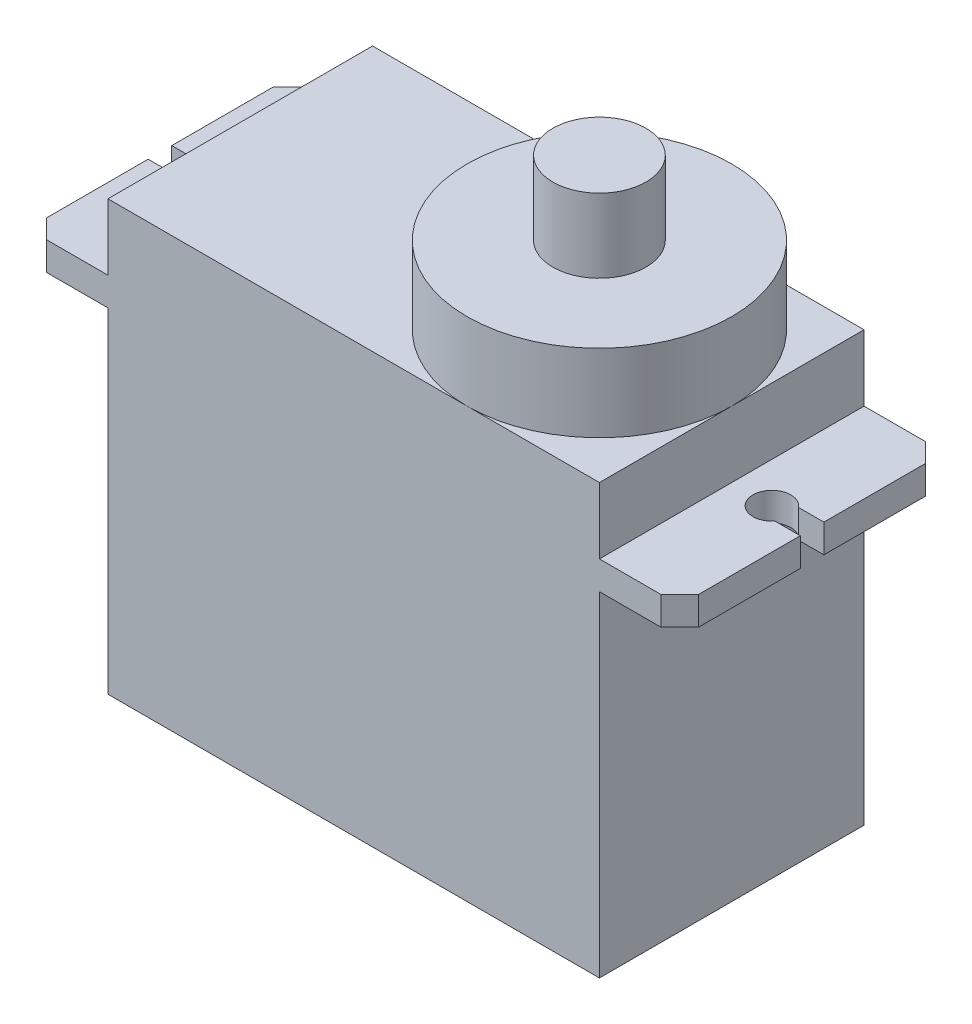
ISO-10303-21;
HEADER;
FILE_DESCRIPTION(('STEP AP214'),'2;1');
FILE_NAME('part.step','',(''),(''),'','','');
FILE_SCHEMA(('AUTOMOTIVE_DESIGN { 1 0 10303 214 1 1 1 1 }'));
ENDSEC;
DATA;
#1=APPLICATION_CONTEXT('core data for automotive mechanical design processes');
#2=APPLICATION_PROTOCOL_DEFINITION('international standard','automotive_design',2000,#1);
#3=PRODUCT_CONTEXT('',#1,'mechanical');
#4=PRODUCT('Part','Part','',(#3));
#5=PRODUCT_RELATED_PRODUCT_CATEGORY('part','',(#4));
#6=PRODUCT_DEFINITION_FORMATION('','',#4);
#7=PRODUCT_DEFINITION_CONTEXT('part definition',#1,'design');
#8=PRODUCT_DEFINITION('design','',#6,#7);
#9=PRODUCT_DEFINITION_SHAPE('','',#8);
#10=(LENGTH_UNIT() NAMED_UNIT(*) SI_UNIT(.MILLI.,.METRE.));
#11=(NAMED_UNIT(*) PLANE_ANGLE_UNIT() SI_UNIT($,.RADIAN.));
#12=(NAMED_UNIT(*) SI_UNIT($,.STERADIAN.) SOLID_ANGLE_UNIT());
#13=UNCERTAINTY_MEASURE_WITH_UNIT(LENGTH_MEASURE(1.E-05),#10,'distance_accuracy_value','');
#14=(GEOMETRIC_REPRESENTATION_CONTEXT(3) GLOBAL_UNCERTAINTY_ASSIGNED_CONTEXT((#13)) GLOBAL_UNIT_ASSIGNED_CONTEXT((#10,
#11,#12)) REPRESENTATION_CONTEXT('',''));
#15=CARTESIAN_POINT('',(0.,0.,0.));
#16=DIRECTION('',(0.,0.,1.));
#17=DIRECTION('',(1.,0.,0.));
#18=AXIS2_PLACEMENT_3D('',#15,#16,#17);
#19=CARTESIAN_POINT('',(30.25,17.7,-14.));
#20=DIRECTION('',(1.,0.,0.));
#21=DIRECTION('',(0.,0.,-1.));
#22=AXIS2_PLACEMENT_3D('',#19,#20,#21);
#23=PLANE('',#22);
#24=DIRECTION('',(0.,-1.,0.));
#25=VECTOR('',#24,1.);
#26=CARTESIAN_POINT('',(30.25,17.7,-6.37500000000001));
#27=LINE('',#26,#25);
#28=CARTESIAN_POINT('',(30.25,19.2,-6.37500000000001));
#29=VERTEX_POINT('',#28);
#30=CARTESIAN_POINT('',(30.25,17.7,-6.37500000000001));
#31=VERTEX_POINT('',#30);
#32=EDGE_CURVE('E536',#29,#31,#27,.T.);
#33=ORIENTED_EDGE('',*,*,#32,.F.);
#34=DIRECTION('',(0.,0.,-1.));
#35=VECTOR('',#34,1.);
#36=CARTESIAN_POINT('',(30.25,19.2,-14.));
#37=LINE('',#36,#35);
#38=CARTESIAN_POINT('',(30.25,19.2,-1.00000000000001));
#39=VERTEX_POINT('',#38);
#40=EDGE_CURVE('E247',#39,#29,#37,.T.);
#41=ORIENTED_EDGE('',*,*,#40,.F.);
#42=DIRECTION('',(0.,-1.,0.));
#43=VECTOR('',#42,1.);
#44=CARTESIAN_POINT('',(30.25,17.7,-1.00000000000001));
#45=LINE('',#44,#43);
#46=CARTESIAN_POINT('',(30.25,17.7,-1.00000000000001));
#47=VERTEX_POINT('',#46);
#48=EDGE_CURVE('E364',#39,#47,#45,.T.);
#49=ORIENTED_EDGE('',*,*,#48,.T.);
#50=DIRECTION('',(0.,0.,-1.));
#51=VECTOR('',#50,1.);
#52=CARTESIAN_POINT('',(30.25,17.7,-14.));
#53=LINE('',#52,#51);
#54=EDGE_CURVE('E441',#47,#31,#53,.T.);
#55=ORIENTED_EDGE('',*,*,#54,.T.);
#56=EDGE_LOOP('',(#33,#41,#49,#55));
#57=FACE_BOUND('',#56,.T.);
#58=ADVANCED_FACE('F47',(#57),#23,.T.);
#59=CARTESIAN_POINT('',(-4.25,17.7,-14.));
#60=DIRECTION('',(-1.,0.,0.));
#61=DIRECTION('',(0.,0.,1.));
#62=AXIS2_PLACEMENT_3D('',#59,#60,#61);
#63=PLANE('',#62);
#64=DIRECTION('',(0.,1.,0.));
#65=VECTOR('',#64,1.);
#66=CARTESIAN_POINT('',(-4.24999999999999,17.7,-6.37500000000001));
#67=LINE('',#66,#65);
#68=CARTESIAN_POINT('',(-4.25,17.7,-6.37500000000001));
#69=VERTEX_POINT('',#68);
#70=CARTESIAN_POINT('',(-4.24999999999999,19.2,-6.37500000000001));
#71=VERTEX_POINT('',#70);
#72=EDGE_CURVE('E534',#69,#71,#67,.T.);
#73=ORIENTED_EDGE('',*,*,#72,.F.);
#74=DIRECTION('',(0.,0.,1.));
#75=VECTOR('',#74,1.);
#76=CARTESIAN_POINT('',(-4.25,17.7,-14.));
#77=LINE('',#76,#75);
#78=CARTESIAN_POINT('',(-4.24999999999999,17.7,-0.999999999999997));
#79=VERTEX_POINT('',#78);
#80=EDGE_CURVE('E262',#69,#79,#77,.T.);
#81=ORIENTED_EDGE('',*,*,#80,.T.);
#82=DIRECTION('',(0.,1.,0.));
#83=VECTOR('',#82,1.);
#84=CARTESIAN_POINT('',(-4.24999999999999,19.2,-0.999999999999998));
#85=LINE('',#84,#83);
#86=CARTESIAN_POINT('',(-4.24999999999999,19.2,-0.999999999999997));
#87=VERTEX_POINT('',#86);
#88=EDGE_CURVE('E343',#79,#87,#85,.T.);
#89=ORIENTED_EDGE('',*,*,#88,.T.);
#90=DIRECTION('',(0.,0.,1.));
#91=VECTOR('',#90,1.);
#92=CARTESIAN_POINT('',(-4.25,19.2,-14.));
#93=LINE('',#92,#91);
#94=EDGE_CURVE('E451',#71,#87,#93,.T.);
#95=ORIENTED_EDGE('',*,*,#94,.F.);
#96=EDGE_LOOP('',(#73,#81,#89,#95));
#97=FACE_BOUND('',#96,.T.);
#98=ADVANCED_FACE('F547',(#97),#63,.T.);
#99=CARTESIAN_POINT('',(0.,22.7,0.));
#100=DIRECTION('',(0.,-1.,0.));
#101=DIRECTION('',(0.,0.,-1.));
#102=AXIS2_PLACEMENT_3D('',#99,#100,#101);
#103=PLANE('',#102);
#104=DIRECTION('',(-1.,0.,0.));
#105=VECTOR('',#104,1.);
#106=CARTESIAN_POINT('',(0.,22.7,-14.));
#107=LINE('',#106,#105);
#108=CARTESIAN_POINT('',(26.,22.7,-14.));
#109=VERTEX_POINT('',#108);
#110=CARTESIAN_POINT('',(19.,22.7,-14.));
#111=VERTEX_POINT('',#110);
#112=EDGE_CURVE('E295',#109,#111,#107,.T.);
#113=ORIENTED_EDGE('',*,*,#112,.T.);
#114=CARTESIAN_POINT('',(19.,22.7,-7.));
#115=DIRECTION('',(0.,-1.,0.));
#116=DIRECTION('',(0.,0.,-1.));
#117=AXIS2_PLACEMENT_3D('',#114,#115,#116);
#118=CIRCLE('',#117,7.);
#119=CARTESIAN_POINT('',(26.,22.7,-7.));
#120=VERTEX_POINT('',#119);
#121=EDGE_CURVE('E432',#111,#120,#118,.T.);
#122=ORIENTED_EDGE('',*,*,#121,.T.);
#123=DIRECTION('',(0.,0.,-1.));
#124=VECTOR('',#123,1.);
#125=CARTESIAN_POINT('',(26.,22.7,0.));
#126=LINE('',#125,#124);
#127=EDGE_CURVE('E289',#120,#109,#126,.T.);
#128=ORIENTED_EDGE('',*,*,#127,.T.);
#129=EDGE_LOOP('',(#113,#122,#128));
#130=FACE_BOUND('',#129,.T.);
#131=ADVANCED_FACE('F549',(#130),#103,.F.);
#132=CARTESIAN_POINT('',(26.,22.7,0.));
#133=VERTEX_POINT('',#132);
#134=EDGE_CURVE('E290',#133,#120,#126,.T.);
#135=ORIENTED_EDGE('',*,*,#134,.T.);
#136=CARTESIAN_POINT('',(19.,22.7,0.));
#137=VERTEX_POINT('',#136);
#138=EDGE_CURVE('E431',#120,#137,#118,.T.);
#139=ORIENTED_EDGE('',*,*,#138,.T.);
#140=DIRECTION('',(1.,0.,0.));
#141=VECTOR('',#140,1.);
#142=CARTESIAN_POINT('',(0.,22.7,0.));
#143=LINE('',#142,#141);
#144=EDGE_CURVE('E283',#137,#133,#143,.T.);
#145=ORIENTED_EDGE('',*,*,#144,.T.);
#146=EDGE_LOOP('',(#135,#139,#145));
#147=FACE_BOUND('',#146,.T.);
#148=ADVANCED_FACE('F467',(#147),#103,.F.);
#149=CARTESIAN_POINT('',(0.,22.7,0.));
#150=DIRECTION('',(1.,0.,0.));
#151=DIRECTION('',(0.,0.,-1.));
#152=AXIS2_PLACEMENT_3D('',#149,#150,#151);
#153=PLANE('',#152);
#154=DIRECTION('',(0.,0.,1.));
#155=VECTOR('',#154,1.);
#156=CARTESIAN_POINT('',(0.,17.7,0.));
#157=LINE('',#156,#155);
#158=CARTESIAN_POINT('',(0.,17.7,-14.));
#159=VERTEX_POINT('',#158);
#160=CARTESIAN_POINT('',(0.,17.7,0.));
#161=VERTEX_POINT('',#160);
#162=EDGE_CURVE('E274',#159,#161,#157,.T.);
#163=ORIENTED_EDGE('',*,*,#162,.F.);
#164=DIRECTION('',(0.,-1.,0.));
#165=VECTOR('',#164,1.);
#166=CARTESIAN_POINT('',(0.,22.7,-14.));
#167=LINE('',#166,#165);
#168=CARTESIAN_POINT('',(0.,0.,-14.));
#169=VERTEX_POINT('',#168);
#170=EDGE_CURVE('E299',#159,#169,#167,.T.);
#171=ORIENTED_EDGE('',*,*,#170,.T.);
#172=DIRECTION('',(0.,0.,1.));
#173=VECTOR('',#172,1.);
#174=CARTESIAN_POINT('',(0.,0.,0.));
#175=LINE('',#174,#173);
#176=CARTESIAN_POINT('',(0.,0.,0.));
#177=VERTEX_POINT('',#176);
#178=EDGE_CURVE('E278',#169,#177,#175,.T.);
#179=ORIENTED_EDGE('',*,*,#178,.T.);
#180=DIRECTION('',(0.,-1.,0.));
#181=VECTOR('',#180,1.);
#182=CARTESIAN_POINT('',(0.,22.7,0.));
#183=LINE('',#182,#181);
#184=EDGE_CURVE('E325',#161,#177,#183,.T.);
#185=ORIENTED_EDGE('',*,*,#184,.F.);
#186=EDGE_LOOP('',(#163,#171,#179,#185));
#187=FACE_BOUND('',#186,.T.);
#188=ADVANCED_FACE('F503',(#187),#153,.F.);
#189=CARTESIAN_POINT('',(26.,22.7,0.));
#190=DIRECTION('',(-1.,0.,0.));
#191=DIRECTION('',(0.,0.,1.));
#192=AXIS2_PLACEMENT_3D('',#189,#190,#191);
#193=PLANE('',#192);
#194=DIRECTION('',(0.,-1.,0.));
#195=VECTOR('',#194,1.);
#196=CARTESIAN_POINT('',(26.,22.7,-14.));
#197=LINE('',#196,#195);
#198=CARTESIAN_POINT('',(26.,17.7,-14.));
#199=VERTEX_POINT('',#198);
#200=CARTESIAN_POINT('',(26.,0.,-14.));
#201=VERTEX_POINT('',#200);
#202=EDGE_CURVE('E315',#199,#201,#197,.T.);
#203=ORIENTED_EDGE('',*,*,#202,.F.);
#204=DIRECTION('',(0.,0.,-1.));
#205=VECTOR('',#204,1.);
#206=CARTESIAN_POINT('',(26.,17.7,0.));
#207=LINE('',#206,#205);
#208=CARTESIAN_POINT('',(26.,17.7,0.));
#209=VERTEX_POINT('',#208);
#210=EDGE_CURVE('E271',#209,#199,#207,.T.);
#211=ORIENTED_EDGE('',*,*,#210,.F.);
#212=DIRECTION('',(0.,-1.,0.));
#213=VECTOR('',#212,1.);
#214=CARTESIAN_POINT('',(26.,22.7,0.));
#215=LINE('',#214,#213);
#216=CARTESIAN_POINT('',(26.,0.,0.));
#217=VERTEX_POINT('',#216);
#218=EDGE_CURVE('E320',#209,#217,#215,.T.);
#219=ORIENTED_EDGE('',*,*,#218,.T.);
#220=DIRECTION('',(0.,0.,-1.));
#221=VECTOR('',#220,1.);
#222=CARTESIAN_POINT('',(26.,0.,0.));
#223=LINE('',#222,#221);
#224=EDGE_CURVE('E306',#217,#201,#223,.T.);
#225=ORIENTED_EDGE('',*,*,#224,.T.);
#226=EDGE_LOOP('',(#203,#211,#219,#225));
#227=FACE_BOUND('',#226,.T.);
#228=ADVANCED_FACE('F592',(#227),#193,.F.);
#229=CARTESIAN_POINT('',(0.,22.7,-14.));
#230=VERTEX_POINT('',#229);
#231=CARTESIAN_POINT('',(0.,19.2,-14.));
#232=VERTEX_POINT('',#231);
#233=EDGE_CURVE('E311',#230,#232,#167,.T.);
#234=ORIENTED_EDGE('',*,*,#233,.T.);
#235=DIRECTION('',(0.,0.,1.));
#236=VECTOR('',#235,1.);
#237=CARTESIAN_POINT('',(0.,19.2,0.));
#238=LINE('',#237,#236);
#239=CARTESIAN_POINT('',(0.,19.2,0.));
#240=VERTEX_POINT('',#239);
#241=EDGE_CURVE('E266',#232,#240,#238,.T.);
#242=ORIENTED_EDGE('',*,*,#241,.T.);
#243=CARTESIAN_POINT('',(0.,22.7,0.));
#244=VERTEX_POINT('',#243);
#245=EDGE_CURVE('E326',#244,#240,#183,.T.);
#246=ORIENTED_EDGE('',*,*,#245,.F.);
#247=DIRECTION('',(0.,0.,1.));
#248=VECTOR('',#247,1.);
#249=CARTESIAN_POINT('',(0.,22.7,0.));
#250=LINE('',#249,#248);
#251=EDGE_CURVE('E279',#230,#244,#250,.T.);
#252=ORIENTED_EDGE('',*,*,#251,.F.);
#253=EDGE_LOOP('',(#234,#242,#246,#252));
#254=FACE_BOUND('',#253,.T.);
#255=ADVANCED_FACE('F482',(#254),#153,.F.);
#256=CARTESIAN_POINT('',(0.,22.7,0.));
#257=DIRECTION('',(0.,0.,-1.));
#258=DIRECTION('',(-1.,0.,0.));
#259=AXIS2_PLACEMENT_3D('',#256,#257,#258);
#260=PLANE('',#259);
#261=ORIENTED_EDGE('',*,*,#144,.F.);
#262=EDGE_CURVE('E285',#244,#137,#143,.T.);
#263=ORIENTED_EDGE('',*,*,#262,.F.);
#264=ORIENTED_EDGE('',*,*,#245,.T.);
#265=DIRECTION('',(1.,0.,0.));
#266=VECTOR('',#265,1.);
#267=CARTESIAN_POINT('',(-4.24999999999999,19.2,0.));
#268=LINE('',#267,#266);
#269=CARTESIAN_POINT('',(-3.24999999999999,19.2,0.));
#270=VERTEX_POINT('',#269);
#271=EDGE_CURVE('E248',#270,#240,#268,.T.);
#272=ORIENTED_EDGE('',*,*,#271,.F.);
#273=DIRECTION('',(0.,-1.,0.));
#274=VECTOR('',#273,1.);
#275=CARTESIAN_POINT('',(-3.24999999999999,17.7,0.));
#276=LINE('',#275,#274);
#277=CARTESIAN_POINT('',(-3.24999999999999,17.7,0.));
#278=VERTEX_POINT('',#277);
#279=EDGE_CURVE('E361',#270,#278,#276,.T.);
#280=ORIENTED_EDGE('',*,*,#279,.T.);
#281=DIRECTION('',(1.,0.,0.));
#282=VECTOR('',#281,1.);
#283=CARTESIAN_POINT('',(-4.24999999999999,17.7,0.));
#284=LINE('',#283,#282);
#285=EDGE_CURVE('E437',#278,#161,#284,.T.);
#286=ORIENTED_EDGE('',*,*,#285,.T.);
#287=ORIENTED_EDGE('',*,*,#184,.T.);
#288=DIRECTION('',(1.,0.,0.));
#289=VECTOR('',#288,1.);
#290=CARTESIAN_POINT('',(0.,0.,0.));
#291=LINE('',#290,#289);
#292=EDGE_CURVE('E303',#177,#217,#291,.T.);
#293=ORIENTED_EDGE('',*,*,#292,.T.);
#294=ORIENTED_EDGE('',*,*,#218,.F.);
#295=CARTESIAN_POINT('',(29.25,17.7,0.));
#296=VERTEX_POINT('',#295);
#297=EDGE_CURVE('E436',#209,#296,#284,.T.);
#298=ORIENTED_EDGE('',*,*,#297,.T.);
#299=DIRECTION('',(0.,1.,0.));
#300=VECTOR('',#299,1.);
#301=CARTESIAN_POINT('',(29.25,19.2,0.));
#302=LINE('',#301,#300);
#303=CARTESIAN_POINT('',(29.25,19.2,0.));
#304=VERTEX_POINT('',#303);
#305=EDGE_CURVE('E357',#296,#304,#302,.T.);
#306=ORIENTED_EDGE('',*,*,#305,.T.);
#307=CARTESIAN_POINT('',(26.,19.2,0.));
#308=VERTEX_POINT('',#307);
#309=EDGE_CURVE('E254',#308,#304,#268,.T.);
#310=ORIENTED_EDGE('',*,*,#309,.F.);
#311=EDGE_CURVE('E321',#133,#308,#215,.T.);
#312=ORIENTED_EDGE('',*,*,#311,.F.);
#313=EDGE_LOOP('',(#261,#263,#264,#272,#280,#286,#287,#293,#294,#298,#306,#310,#312));
#314=FACE_BOUND('',#313,.T.);
#315=ADVANCED_FACE('F472',(#314),#260,.F.);
#316=ORIENTED_EDGE('',*,*,#127,.F.);
#317=ORIENTED_EDGE('',*,*,#134,.F.);
#318=ORIENTED_EDGE('',*,*,#311,.T.);
#319=DIRECTION('',(0.,0.,-1.));
#320=VECTOR('',#319,1.);
#321=CARTESIAN_POINT('',(26.,19.2,0.));
#322=LINE('',#321,#320);
#323=CARTESIAN_POINT('',(26.,19.2,-14.));
#324=VERTEX_POINT('',#323);
#325=EDGE_CURVE('E263',#308,#324,#322,.T.);
#326=ORIENTED_EDGE('',*,*,#325,.T.);
#327=EDGE_CURVE('E316',#109,#324,#197,.T.);
#328=ORIENTED_EDGE('',*,*,#327,.F.);
#329=EDGE_LOOP('',(#316,#317,#318,#326,#328));
#330=FACE_BOUND('',#329,.T.);
#331=ADVANCED_FACE('F588',(#330),#193,.F.);
#332=CARTESIAN_POINT('',(0.,22.7,-14.));
#333=DIRECTION('',(0.,0.,1.));
#334=DIRECTION('',(1.,0.,0.));
#335=AXIS2_PLACEMENT_3D('',#332,#333,#334);
#336=PLANE('',#335);
#337=EDGE_CURVE('E294',#111,#230,#107,.T.);
#338=ORIENTED_EDGE('',*,*,#337,.F.);
#339=ORIENTED_EDGE('',*,*,#112,.F.);
#340=ORIENTED_EDGE('',*,*,#327,.T.);
#341=DIRECTION('',(-1.,0.,0.));
#342=VECTOR('',#341,1.);
#343=CARTESIAN_POINT('',(-4.25,19.2,-14.));
#344=LINE('',#343,#342);
#345=CARTESIAN_POINT('',(29.25,19.2,-14.));
#346=VERTEX_POINT('',#345);
#347=EDGE_CURVE('E258',#346,#324,#344,.T.);
#348=ORIENTED_EDGE('',*,*,#347,.F.);
#349=DIRECTION('',(0.,-1.,0.));
#350=VECTOR('',#349,1.);
#351=CARTESIAN_POINT('',(29.25,17.7,-14.));
#352=LINE('',#351,#350);
#353=CARTESIAN_POINT('',(29.25,17.7,-14.));
#354=VERTEX_POINT('',#353);
#355=EDGE_CURVE('E330',#346,#354,#352,.T.);
#356=ORIENTED_EDGE('',*,*,#355,.T.);
#357=DIRECTION('',(-1.,0.,0.));
#358=VECTOR('',#357,1.);
#359=CARTESIAN_POINT('',(-4.25,17.7,-14.));
#360=LINE('',#359,#358);
#361=EDGE_CURVE('E267',#354,#199,#360,.T.);
#362=ORIENTED_EDGE('',*,*,#361,.T.);
#363=ORIENTED_EDGE('',*,*,#202,.T.);
#364=DIRECTION('',(-1.,0.,0.));
#365=VECTOR('',#364,1.);
#366=CARTESIAN_POINT('',(0.,0.,-14.));
#367=LINE('',#366,#365);
#368=EDGE_CURVE('E284',#201,#169,#367,.T.);
#369=ORIENTED_EDGE('',*,*,#368,.T.);
#370=ORIENTED_EDGE('',*,*,#170,.F.);
#371=CARTESIAN_POINT('',(-3.24999999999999,17.7,-14.));
#372=VERTEX_POINT('',#371);
#373=EDGE_CURVE('E445',#159,#372,#360,.T.);
#374=ORIENTED_EDGE('',*,*,#373,.T.);
#375=DIRECTION('',(0.,1.,0.));
#376=VECTOR('',#375,1.);
#377=CARTESIAN_POINT('',(-3.24999999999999,19.2,-14.));
#378=LINE('',#377,#376);
#379=CARTESIAN_POINT('',(-3.24999999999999,19.2,-14.));
#380=VERTEX_POINT('',#379);
#381=EDGE_CURVE('E333',#372,#380,#378,.T.);
#382=ORIENTED_EDGE('',*,*,#381,.T.);
#383=EDGE_CURVE('E253',#232,#380,#344,.T.);
#384=ORIENTED_EDGE('',*,*,#383,.F.);
#385=ORIENTED_EDGE('',*,*,#233,.F.);
#386=EDGE_LOOP('',(#338,#339,#340,#348,#356,#362,#363,#369,#370,#374,#382,#384,#385));
#387=FACE_BOUND('',#386,.T.);
#388=ADVANCED_FACE('F520',(#387),#336,.F.);
#389=ORIENTED_EDGE('',*,*,#262,.T.);
#390=EDGE_CURVE('E427',#137,#111,#118,.T.);
#391=ORIENTED_EDGE('',*,*,#390,.T.);
#392=ORIENTED_EDGE('',*,*,#337,.T.);
#393=ORIENTED_EDGE('',*,*,#251,.T.);
#394=EDGE_LOOP('',(#389,#391,#392,#393));
#395=FACE_BOUND('',#394,.T.);
#396=ADVANCED_FACE('F476',(#395),#103,.F.);
#397=CARTESIAN_POINT('',(0.,0.,0.));
#398=DIRECTION('',(0.,-1.,0.));
#399=DIRECTION('',(0.,0.,-1.));
#400=AXIS2_PLACEMENT_3D('',#397,#398,#399);
#401=PLANE('',#400);
#402=ORIENTED_EDGE('',*,*,#178,.F.);
#403=ORIENTED_EDGE('',*,*,#368,.F.);
#404=ORIENTED_EDGE('',*,*,#224,.F.);
#405=ORIENTED_EDGE('',*,*,#292,.F.);
#406=EDGE_LOOP('',(#402,#403,#404,#405));
#407=FACE_BOUND('',#406,.T.);
#408=ADVANCED_FACE('F500',(#407),#401,.T.);
#409=DIRECTION('',(0.,1.,0.));
#410=VECTOR('',#409,1.);
#411=CARTESIAN_POINT('',(30.25,17.7,-7.62500000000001));
#412=LINE('',#411,#410);
#413=CARTESIAN_POINT('',(30.25,17.7,-7.62500000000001));
#414=VERTEX_POINT('',#413);
#415=CARTESIAN_POINT('',(30.25,19.2,-7.62500000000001));
#416=VERTEX_POINT('',#415);
#417=EDGE_CURVE('E217',#414,#416,#412,.T.);
#418=ORIENTED_EDGE('',*,*,#417,.F.);
#419=CARTESIAN_POINT('',(30.25,17.7,-13.));
#420=VERTEX_POINT('',#419);
#421=EDGE_CURVE('E440',#414,#420,#53,.T.);
#422=ORIENTED_EDGE('',*,*,#421,.T.);
#423=DIRECTION('',(0.,1.,0.));
#424=VECTOR('',#423,1.);
#425=CARTESIAN_POINT('',(30.25,19.2,-13.));
#426=LINE('',#425,#424);
#427=CARTESIAN_POINT('',(30.25,19.2,-13.));
#428=VERTEX_POINT('',#427);
#429=EDGE_CURVE('E245',#420,#428,#426,.T.);
#430=ORIENTED_EDGE('',*,*,#429,.T.);
#431=EDGE_CURVE('E234',#416,#428,#37,.T.);
#432=ORIENTED_EDGE('',*,*,#431,.F.);
#433=EDGE_LOOP('',(#418,#422,#430,#432));
#434=FACE_BOUND('',#433,.T.);
#435=ADVANCED_FACE('F243',(#434),#23,.T.);
#436=CARTESIAN_POINT('',(0.,19.2,0.));
#437=DIRECTION('',(0.,1.,0.));
#438=DIRECTION('',(0.,0.,1.));
#439=AXIS2_PLACEMENT_3D('',#436,#437,#438);
#440=PLANE('',#439);
#441=DIRECTION('',(1.,0.,0.));
#442=VECTOR('',#441,1.);
#443=CARTESIAN_POINT('',(28.023094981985,19.2,-6.37500000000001));
#444=LINE('',#443,#442);
#445=CARTESIAN_POINT('',(28.9056247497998,19.2,-6.37500000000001));
#446=VERTEX_POINT('',#445);
#447=EDGE_CURVE('E239',#446,#29,#444,.T.);
#448=ORIENTED_EDGE('',*,*,#447,.F.);
#449=CARTESIAN_POINT('',(28.125,19.2,-7.00000000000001));
#450=DIRECTION('',(0.,1.,0.));
#451=DIRECTION('',(0.,0.,1.));
#452=AXIS2_PLACEMENT_3D('',#449,#450,#451);
#453=CIRCLE('',#452,1.);
#454=CARTESIAN_POINT('',(28.9056247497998,19.2,-7.62500000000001));
#455=VERTEX_POINT('',#454);
#456=EDGE_CURVE('E237',#455,#446,#453,.T.);
#457=ORIENTED_EDGE('',*,*,#456,.F.);
#458=DIRECTION('',(-1.,0.,0.));
#459=VECTOR('',#458,1.);
#460=CARTESIAN_POINT('',(28.023094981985,19.2,-7.62500000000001));
#461=LINE('',#460,#459);
#462=EDGE_CURVE('E220',#416,#455,#461,.T.);
#463=ORIENTED_EDGE('',*,*,#462,.F.);
#464=ORIENTED_EDGE('',*,*,#431,.T.);
#465=DIRECTION('',(-0.707106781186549,0.,-0.707106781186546));
#466=VECTOR('',#465,1.);
#467=CARTESIAN_POINT('',(21.625,19.2,-21.625));
#468=LINE('',#467,#466);
#469=EDGE_CURVE('E372',#428,#346,#468,.T.);
#470=ORIENTED_EDGE('',*,*,#469,.T.);
#471=ORIENTED_EDGE('',*,*,#347,.T.);
#472=ORIENTED_EDGE('',*,*,#325,.F.);
#473=ORIENTED_EDGE('',*,*,#309,.T.);
#474=DIRECTION('',(0.707106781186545,0.,-0.70710678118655));
#475=VECTOR('',#474,1.);
#476=CARTESIAN_POINT('',(14.6250000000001,19.2,14.625));
#477=LINE('',#476,#475);
#478=EDGE_CURVE('E369',#304,#39,#477,.T.);
#479=ORIENTED_EDGE('',*,*,#478,.T.);
#480=ORIENTED_EDGE('',*,*,#40,.T.);
#481=EDGE_LOOP('',(#448,#457,#463,#464,#470,#471,#472,#473,#479,#480));
#482=FACE_BOUND('',#481,.T.);
#483=ADVANCED_FACE('F233',(#482),#440,.T.);
#484=CARTESIAN_POINT('',(0.,17.7,0.));
#485=DIRECTION('',(0.,1.,0.));
#486=DIRECTION('',(0.,0.,1.));
#487=AXIS2_PLACEMENT_3D('',#484,#485,#486);
#488=PLANE('',#487);
#489=CARTESIAN_POINT('',(28.125,17.7,-7.00000000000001));
#490=DIRECTION('',(0.,1.,0.));
#491=DIRECTION('',(0.,0.,1.));
#492=AXIS2_PLACEMENT_3D('',#489,#490,#491);
#493=CIRCLE('',#492,1.);
#494=CARTESIAN_POINT('',(28.9056247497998,17.7,-7.62500000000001));
#495=VERTEX_POINT('',#494);
#496=CARTESIAN_POINT('',(28.9056247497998,17.7,-6.37500000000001));
#497=VERTEX_POINT('',#496);
#498=EDGE_CURVE('E383',#495,#497,#493,.T.);
#499=ORIENTED_EDGE('',*,*,#498,.T.);
#500=DIRECTION('',(1.,0.,0.));
#501=VECTOR('',#500,1.);
#502=CARTESIAN_POINT('',(0.,17.7,-6.37500000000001));
#503=LINE('',#502,#501);
#504=EDGE_CURVE('E228',#497,#31,#503,.T.);
#505=ORIENTED_EDGE('',*,*,#504,.T.);
#506=ORIENTED_EDGE('',*,*,#54,.F.);
#507=DIRECTION('',(-0.707106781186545,0.,0.70710678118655));
#508=VECTOR('',#507,1.);
#509=CARTESIAN_POINT('',(29.25,17.7,0.));
#510=LINE('',#509,#508);
#511=EDGE_CURVE('E375',#47,#296,#510,.T.);
#512=ORIENTED_EDGE('',*,*,#511,.T.);
#513=ORIENTED_EDGE('',*,*,#297,.F.);
#514=ORIENTED_EDGE('',*,*,#210,.T.);
#515=ORIENTED_EDGE('',*,*,#361,.F.);
#516=DIRECTION('',(0.707106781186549,0.,0.707106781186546));
#517=VECTOR('',#516,1.);
#518=CARTESIAN_POINT('',(30.25,17.7,-13.));
#519=LINE('',#518,#517);
#520=EDGE_CURVE('E378',#354,#420,#519,.T.);
#521=ORIENTED_EDGE('',*,*,#520,.T.);
#522=ORIENTED_EDGE('',*,*,#421,.F.);
#523=DIRECTION('',(-1.,0.,0.));
#524=VECTOR('',#523,1.);
#525=CARTESIAN_POINT('',(0.,17.7,-7.62500000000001));
#526=LINE('',#525,#524);
#527=EDGE_CURVE('E223',#414,#495,#526,.T.);
#528=ORIENTED_EDGE('',*,*,#527,.T.);
#529=EDGE_LOOP('',(#499,#505,#506,#512,#513,#514,#515,#521,#522,#528));
#530=FACE_BOUND('',#529,.T.);
#531=ADVANCED_FACE('F570',(#530),#488,.F.);
#532=ORIENTED_EDGE('',*,*,#80,.F.);
#533=DIRECTION('',(1.,0.,0.));
#534=VECTOR('',#533,1.);
#535=CARTESIAN_POINT('',(0.,17.7,-6.37500000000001));
#536=LINE('',#535,#534);
#537=CARTESIAN_POINT('',(-2.9056247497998,17.7,-6.37500000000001));
#538=VERTEX_POINT('',#537);
#539=EDGE_CURVE('E410',#69,#538,#536,.T.);
#540=ORIENTED_EDGE('',*,*,#539,.T.);
#541=CARTESIAN_POINT('',(-2.125,17.7,-7.00000000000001));
#542=DIRECTION('',(0.,1.,0.));
#543=DIRECTION('',(0.,0.,1.));
#544=AXIS2_PLACEMENT_3D('',#541,#542,#543);
#545=CIRCLE('',#544,1.);
#546=CARTESIAN_POINT('',(-2.9056247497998,17.7,-7.62500000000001));
#547=VERTEX_POINT('',#546);
#548=EDGE_CURVE('E388',#538,#547,#545,.T.);
#549=ORIENTED_EDGE('',*,*,#548,.T.);
#550=DIRECTION('',(-1.,0.,0.));
#551=VECTOR('',#550,1.);
#552=CARTESIAN_POINT('',(0.,17.7,-7.62500000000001));
#553=LINE('',#552,#551);
#554=CARTESIAN_POINT('',(-4.25,17.7,-7.62500000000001));
#555=VERTEX_POINT('',#554);
#556=EDGE_CURVE('E64',#547,#555,#553,.T.);
#557=ORIENTED_EDGE('',*,*,#556,.T.);
#558=CARTESIAN_POINT('',(-4.25,17.7,-13.));
#559=VERTEX_POINT('',#558);
#560=EDGE_CURVE('E433',#559,#555,#77,.T.);
#561=ORIENTED_EDGE('',*,*,#560,.F.);
#562=DIRECTION('',(0.707106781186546,0.,-0.707106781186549));
#563=VECTOR('',#562,1.);
#564=CARTESIAN_POINT('',(-3.24999999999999,17.7,-14.));
#565=LINE('',#564,#563);
#566=EDGE_CURVE('E354',#559,#372,#565,.T.);
#567=ORIENTED_EDGE('',*,*,#566,.T.);
#568=ORIENTED_EDGE('',*,*,#373,.F.);
#569=ORIENTED_EDGE('',*,*,#162,.T.);
#570=ORIENTED_EDGE('',*,*,#285,.F.);
#571=DIRECTION('',(-0.707106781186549,0.,-0.707106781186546));
#572=VECTOR('',#571,1.);
#573=CARTESIAN_POINT('',(-4.24999999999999,17.7,-0.999999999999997));
#574=LINE('',#573,#572);
#575=EDGE_CURVE('E350',#278,#79,#574,.T.);
#576=ORIENTED_EDGE('',*,*,#575,.T.);
#577=EDGE_LOOP('',(#532,#540,#549,#557,#561,#567,#568,#569,#570,#576));
#578=FACE_BOUND('',#577,.T.);
#579=ADVANCED_FACE('F407',(#578),#488,.F.);
#580=DIRECTION('',(1.,0.,0.));
#581=VECTOR('',#580,1.);
#582=CARTESIAN_POINT('',(-12.5678089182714,19.2,-6.37500000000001));
#583=LINE('',#582,#581);
#584=CARTESIAN_POINT('',(-2.9056247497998,19.2,-6.37500000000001));
#585=VERTEX_POINT('',#584);
#586=EDGE_CURVE('E72',#71,#585,#583,.T.);
#587=ORIENTED_EDGE('',*,*,#586,.F.);
#588=ORIENTED_EDGE('',*,*,#94,.T.);
#589=DIRECTION('',(0.707106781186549,0.,0.707106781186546));
#590=VECTOR('',#589,1.);
#591=CARTESIAN_POINT('',(-1.62499999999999,19.2,1.625));
#592=LINE('',#591,#590);
#593=EDGE_CURVE('E337',#87,#270,#592,.T.);
#594=ORIENTED_EDGE('',*,*,#593,.T.);
#595=ORIENTED_EDGE('',*,*,#271,.T.);
#596=ORIENTED_EDGE('',*,*,#241,.F.);
#597=ORIENTED_EDGE('',*,*,#383,.T.);
#598=DIRECTION('',(-0.707106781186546,0.,0.707106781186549));
#599=VECTOR('',#598,1.);
#600=CARTESIAN_POINT('',(-8.625,19.2,-8.62499999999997));
#601=LINE('',#600,#599);
#602=CARTESIAN_POINT('',(-4.25,19.2,-13.));
#603=VERTEX_POINT('',#602);
#604=EDGE_CURVE('E340',#380,#603,#601,.T.);
#605=ORIENTED_EDGE('',*,*,#604,.T.);
#606=CARTESIAN_POINT('',(-4.24999999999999,19.2,-7.62500000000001));
#607=VERTEX_POINT('',#606);
#608=EDGE_CURVE('E448',#603,#607,#93,.T.);
#609=ORIENTED_EDGE('',*,*,#608,.T.);
#610=DIRECTION('',(-1.,0.,0.));
#611=VECTOR('',#610,1.);
#612=CARTESIAN_POINT('',(-12.5678089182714,19.2,-7.62500000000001));
#613=LINE('',#612,#611);
#614=CARTESIAN_POINT('',(-2.9056247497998,19.2,-7.62500000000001));
#615=VERTEX_POINT('',#614);
#616=EDGE_CURVE('E240',#615,#607,#613,.T.);
#617=ORIENTED_EDGE('',*,*,#616,.F.);
#618=CARTESIAN_POINT('',(-2.125,19.2,-7.00000000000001));
#619=DIRECTION('',(0.,1.,0.));
#620=DIRECTION('',(0.,0.,1.));
#621=AXIS2_PLACEMENT_3D('',#618,#619,#620);
#622=CIRCLE('',#621,1.);
#623=EDGE_CURVE('E402',#585,#615,#622,.T.);
#624=ORIENTED_EDGE('',*,*,#623,.F.);
#625=EDGE_LOOP('',(#587,#588,#594,#595,#596,#597,#605,#609,#617,#624));
#626=FACE_BOUND('',#625,.T.);
#627=ADVANCED_FACE('F519',(#626),#440,.T.);
#628=DIRECTION('',(0.,-1.,0.));
#629=VECTOR('',#628,1.);
#630=CARTESIAN_POINT('',(-4.24999999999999,17.7,-7.62500000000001));
#631=LINE('',#630,#629);
#632=EDGE_CURVE('E529',#607,#555,#631,.T.);
#633=ORIENTED_EDGE('',*,*,#632,.F.);
#634=ORIENTED_EDGE('',*,*,#608,.F.);
#635=DIRECTION('',(0.,-1.,0.));
#636=VECTOR('',#635,1.);
#637=CARTESIAN_POINT('',(-4.25,17.7,-13.));
#638=LINE('',#637,#636);
#639=EDGE_CURVE('E347',#603,#559,#638,.T.);
#640=ORIENTED_EDGE('',*,*,#639,.T.);
#641=ORIENTED_EDGE('',*,*,#560,.T.);
#642=EDGE_LOOP('',(#633,#634,#640,#641));
#643=FACE_BOUND('',#642,.T.);
#644=ADVANCED_FACE('F528',(#643),#63,.T.);
#645=CARTESIAN_POINT('',(-3.24999999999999,22.7,-14.));
#646=DIRECTION('',(-0.707106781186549,0.,-0.707106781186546));
#647=DIRECTION('',(0.,-1.,0.));
#648=AXIS2_PLACEMENT_3D('',#645,#646,#647);
#649=PLANE('',#648);
#650=ORIENTED_EDGE('',*,*,#566,.F.);
#651=ORIENTED_EDGE('',*,*,#639,.F.);
#652=ORIENTED_EDGE('',*,*,#604,.F.);
#653=ORIENTED_EDGE('',*,*,#381,.F.);
#654=EDGE_LOOP('',(#650,#651,#652,#653));
#655=FACE_BOUND('',#654,.T.);
#656=ADVANCED_FACE('F524',(#655),#649,.T.);
#657=CARTESIAN_POINT('',(-4.24999999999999,17.7,-0.999999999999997));
#658=DIRECTION('',(-0.707106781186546,0.,0.707106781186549));
#659=DIRECTION('',(0.,-1.,0.));
#660=AXIS2_PLACEMENT_3D('',#657,#658,#659);
#661=PLANE('',#660);
#662=ORIENTED_EDGE('',*,*,#575,.F.);
#663=ORIENTED_EDGE('',*,*,#279,.F.);
#664=ORIENTED_EDGE('',*,*,#593,.F.);
#665=ORIENTED_EDGE('',*,*,#88,.F.);
#666=EDGE_LOOP('',(#662,#663,#664,#665));
#667=FACE_BOUND('',#666,.T.);
#668=ADVANCED_FACE('F488',(#667),#661,.T.);
#669=CARTESIAN_POINT('',(30.25,17.7,-13.));
#670=DIRECTION('',(0.707106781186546,0.,-0.707106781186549));
#671=DIRECTION('',(0.,-1.,0.));
#672=AXIS2_PLACEMENT_3D('',#669,#670,#671);
#673=PLANE('',#672);
#674=ORIENTED_EDGE('',*,*,#520,.F.);
#675=ORIENTED_EDGE('',*,*,#355,.F.);
#676=ORIENTED_EDGE('',*,*,#469,.F.);
#677=ORIENTED_EDGE('',*,*,#429,.F.);
#678=EDGE_LOOP('',(#674,#675,#676,#677));
#679=FACE_BOUND('',#678,.T.);
#680=ADVANCED_FACE('F605',(#679),#673,.T.);
#681=CARTESIAN_POINT('',(29.25,22.7,0.));
#682=DIRECTION('',(0.70710678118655,0.,0.707106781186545));
#683=DIRECTION('',(0.,-1.,0.));
#684=AXIS2_PLACEMENT_3D('',#681,#682,#683);
#685=PLANE('',#684);
#686=ORIENTED_EDGE('',*,*,#511,.F.);
#687=ORIENTED_EDGE('',*,*,#48,.F.);
#688=ORIENTED_EDGE('',*,*,#478,.F.);
#689=ORIENTED_EDGE('',*,*,#305,.F.);
#690=EDGE_LOOP('',(#686,#687,#688,#689));
#691=FACE_BOUND('',#690,.T.);
#692=ADVANCED_FACE('F50',(#691),#685,.T.);
#693=CARTESIAN_POINT('',(19.,26.8,-7.));
#694=DIRECTION('',(0.,-1.,0.));
#695=DIRECTION('',(0.,0.,-1.));
#696=AXIS2_PLACEMENT_3D('',#693,#694,#695);
#697=CYLINDRICAL_SURFACE('',#696,7.);
#698=CARTESIAN_POINT('',(19.,26.8,-7.));
#699=DIRECTION('',(0.,-1.,0.));
#700=DIRECTION('',(0.,0.,-1.));
#701=AXIS2_PLACEMENT_3D('',#698,#699,#700);
#702=CIRCLE('',#701,7.);
#703=CARTESIAN_POINT('',(19.,26.8,-14.));
#704=VERTEX_POINT('',#703);
#705=EDGE_CURVE('E420',#704,#704,#702,.T.);
#706=ORIENTED_EDGE('',*,*,#705,.T.);
#707=EDGE_LOOP('',(#706));
#708=FACE_BOUND('',#707,.T.);
#709=ORIENTED_EDGE('',*,*,#121,.F.);
#710=ORIENTED_EDGE('',*,*,#390,.F.);
#711=ORIENTED_EDGE('',*,*,#138,.F.);
#712=EDGE_LOOP('',(#709,#710,#711));
#713=FACE_BOUND('',#712,.T.);
#714=ADVANCED_FACE('F613',(#708,#713),#697,.T.);
#715=CARTESIAN_POINT('',(19.,26.8,-7.));
#716=DIRECTION('',(0.,-1.,0.));
#717=DIRECTION('',(0.,0.,-1.));
#718=AXIS2_PLACEMENT_3D('',#715,#716,#717);
#719=PLANE('',#718);
#720=CARTESIAN_POINT('',(19.,26.8,-7.));
#721=DIRECTION('',(0.,1.,0.));
#722=DIRECTION('',(0.,0.,1.));
#723=AXIS2_PLACEMENT_3D('',#720,#721,#722);
#724=CIRCLE('',#723,2.465);
#725=CARTESIAN_POINT('',(19.,26.8,-4.535));
#726=VERTEX_POINT('',#725);
#727=EDGE_CURVE('E382',#726,#726,#724,.T.);
#728=ORIENTED_EDGE('',*,*,#727,.F.);
#729=EDGE_LOOP('',(#728));
#730=FACE_BOUND('',#729,.T.);
#731=ORIENTED_EDGE('',*,*,#705,.F.);
#732=EDGE_LOOP('',(#731));
#733=FACE_BOUND('',#732,.T.);
#734=ADVANCED_FACE('F662',(#730,#733),#719,.F.);
#735=CARTESIAN_POINT('',(19.,30.7,-7.));
#736=DIRECTION('',(0.,-1.,0.));
#737=DIRECTION('',(0.,0.,-1.));
#738=AXIS2_PLACEMENT_3D('',#735,#736,#737);
#739=CYLINDRICAL_SURFACE('',#738,2.465);
#740=CARTESIAN_POINT('',(19.,30.7,-7.));
#741=DIRECTION('',(0.,1.,0.));
#742=DIRECTION('',(0.,0.,1.));
#743=AXIS2_PLACEMENT_3D('',#740,#741,#742);
#744=CIRCLE('',#743,2.465);
#745=CARTESIAN_POINT('',(19.,30.7,-4.535));
#746=VERTEX_POINT('',#745);
#747=EDGE_CURVE('E387',#746,#746,#744,.T.);
#748=ORIENTED_EDGE('',*,*,#747,.F.);
#749=EDGE_LOOP('',(#748));
#750=FACE_BOUND('',#749,.T.);
#751=ORIENTED_EDGE('',*,*,#727,.T.);
#752=EDGE_LOOP('',(#751));
#753=FACE_BOUND('',#752,.T.);
#754=ADVANCED_FACE('F658',(#750,#753),#739,.T.);
#755=CARTESIAN_POINT('',(19.,30.7,-7.));
#756=DIRECTION('',(0.,1.,0.));
#757=DIRECTION('',(0.,0.,1.));
#758=AXIS2_PLACEMENT_3D('',#755,#756,#757);
#759=PLANE('',#758);
#760=ORIENTED_EDGE('',*,*,#747,.T.);
#761=EDGE_LOOP('',(#760));
#762=FACE_BOUND('',#761,.T.);
#763=ADVANCED_FACE('F651',(#762),#759,.T.);
#764=CARTESIAN_POINT('',(-2.125,0.,-7.00000000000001));
#765=DIRECTION('',(0.,1.,0.));
#766=DIRECTION('',(0.,0.,1.));
#767=AXIS2_PLACEMENT_3D('',#764,#765,#766);
#768=CYLINDRICAL_SURFACE('',#767,1.);
#769=ORIENTED_EDGE('',*,*,#548,.F.);
#770=DIRECTION('',(0.,1.,0.));
#771=VECTOR('',#770,1.);
#772=CARTESIAN_POINT('',(-2.9056247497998,0.,-6.37500000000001));
#773=LINE('',#772,#771);
#774=EDGE_CURVE('E11',#538,#585,#773,.T.);
#775=ORIENTED_EDGE('',*,*,#774,.T.);
#776=ORIENTED_EDGE('',*,*,#623,.T.);
#777=DIRECTION('',(0.,1.,0.));
#778=VECTOR('',#777,1.);
#779=CARTESIAN_POINT('',(-2.9056247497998,0.,-7.62500000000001));
#780=LINE('',#779,#778);
#781=EDGE_CURVE('E57',#615,#547,#780,.F.);
#782=ORIENTED_EDGE('',*,*,#781,.T.);
#783=EDGE_LOOP('',(#769,#775,#776,#782));
#784=FACE_BOUND('',#783,.T.);
#785=ADVANCED_FACE('F400',(#784),#768,.F.);
#786=CARTESIAN_POINT('',(28.125,0.,-7.00000000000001));
#787=DIRECTION('',(0.,1.,0.));
#788=DIRECTION('',(0.,0.,1.));
#789=AXIS2_PLACEMENT_3D('',#786,#787,#788);
#790=CYLINDRICAL_SURFACE('',#789,1.);
#791=ORIENTED_EDGE('',*,*,#456,.T.);
#792=DIRECTION('',(0.,1.,0.));
#793=VECTOR('',#792,1.);
#794=CARTESIAN_POINT('',(28.9056247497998,0.,-6.37500000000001));
#795=LINE('',#794,#793);
#796=EDGE_CURVE('E392',#446,#497,#795,.F.);
#797=ORIENTED_EDGE('',*,*,#796,.T.);
#798=ORIENTED_EDGE('',*,*,#498,.F.);
#799=DIRECTION('',(0.,1.,0.));
#800=VECTOR('',#799,1.);
#801=CARTESIAN_POINT('',(28.9056247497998,0.,-7.62500000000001));
#802=LINE('',#801,#800);
#803=EDGE_CURVE('E389',#495,#455,#802,.T.);
#804=ORIENTED_EDGE('',*,*,#803,.T.);
#805=EDGE_LOOP('',(#791,#797,#798,#804));
#806=FACE_BOUND('',#805,.T.);
#807=ADVANCED_FACE('F643',(#806),#790,.F.);
#808=CARTESIAN_POINT('',(28.023094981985,0.,-7.62500000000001));
#809=DIRECTION('',(0.,0.,-1.));
#810=DIRECTION('',(-1.,0.,0.));
#811=AXIS2_PLACEMENT_3D('',#808,#809,#810);
#812=PLANE('',#811);
#813=ORIENTED_EDGE('',*,*,#417,.T.);
#814=ORIENTED_EDGE('',*,*,#462,.T.);
#815=ORIENTED_EDGE('',*,*,#803,.F.);
#816=ORIENTED_EDGE('',*,*,#527,.F.);
#817=EDGE_LOOP('',(#813,#814,#815,#816));
#818=FACE_BOUND('',#817,.T.);
#819=ADVANCED_FACE('F219',(#818),#812,.F.);
#820=CARTESIAN_POINT('',(28.023094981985,0.,-6.37500000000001));
#821=DIRECTION('',(0.,0.,1.));
#822=DIRECTION('',(1.,0.,0.));
#823=AXIS2_PLACEMENT_3D('',#820,#821,#822);
#824=PLANE('',#823);
#825=ORIENTED_EDGE('',*,*,#32,.T.);
#826=ORIENTED_EDGE('',*,*,#504,.F.);
#827=ORIENTED_EDGE('',*,*,#796,.F.);
#828=ORIENTED_EDGE('',*,*,#447,.T.);
#829=EDGE_LOOP('',(#825,#826,#827,#828));
#830=FACE_BOUND('',#829,.T.);
#831=ADVANCED_FACE('F641',(#830),#824,.F.);
#832=CARTESIAN_POINT('',(-12.5678089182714,0.,-7.62500000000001));
#833=DIRECTION('',(0.,0.,-1.));
#834=DIRECTION('',(-1.,0.,0.));
#835=AXIS2_PLACEMENT_3D('',#832,#833,#834);
#836=PLANE('',#835);
#837=ORIENTED_EDGE('',*,*,#632,.T.);
#838=ORIENTED_EDGE('',*,*,#556,.F.);
#839=ORIENTED_EDGE('',*,*,#781,.F.);
#840=ORIENTED_EDGE('',*,*,#616,.T.);
#841=EDGE_LOOP('',(#837,#838,#839,#840));
#842=FACE_BOUND('',#841,.T.);
#843=ADVANCED_FACE('F711',(#842),#836,.F.);
#844=CARTESIAN_POINT('',(-12.5678089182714,0.,-6.37500000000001));
#845=DIRECTION('',(0.,0.,1.));
#846=DIRECTION('',(1.,0.,0.));
#847=AXIS2_PLACEMENT_3D('',#844,#845,#846);
#848=PLANE('',#847);
#849=ORIENTED_EDGE('',*,*,#72,.T.);
#850=ORIENTED_EDGE('',*,*,#586,.T.);
#851=ORIENTED_EDGE('',*,*,#774,.F.);
#852=ORIENTED_EDGE('',*,*,#539,.F.);
#853=EDGE_LOOP('',(#849,#850,#851,#852));
#854=FACE_BOUND('',#853,.T.);
#855=ADVANCED_FACE('F543',(#854),#848,.F.);
#856=CLOSED_SHELL('',(#58,#98,#131,#148,#188,#228,#255,#315,#331,#388,#396,#408,#435,#483,#531,
#579,#627,#644,#656,#668,#680,#692,#714,#734,#754,#763,#785,#807,#819,#831,#843,#855));
#857=MANIFOLD_SOLID_BREP('B2',#856);
#858=ADVANCED_BREP_SHAPE_REPRESENTATION('',(#18,#857),#14);
#859=SHAPE_DEFINITION_REPRESENTATION(#9,#858);
ENDSEC;
END-ISO-10303-21;
